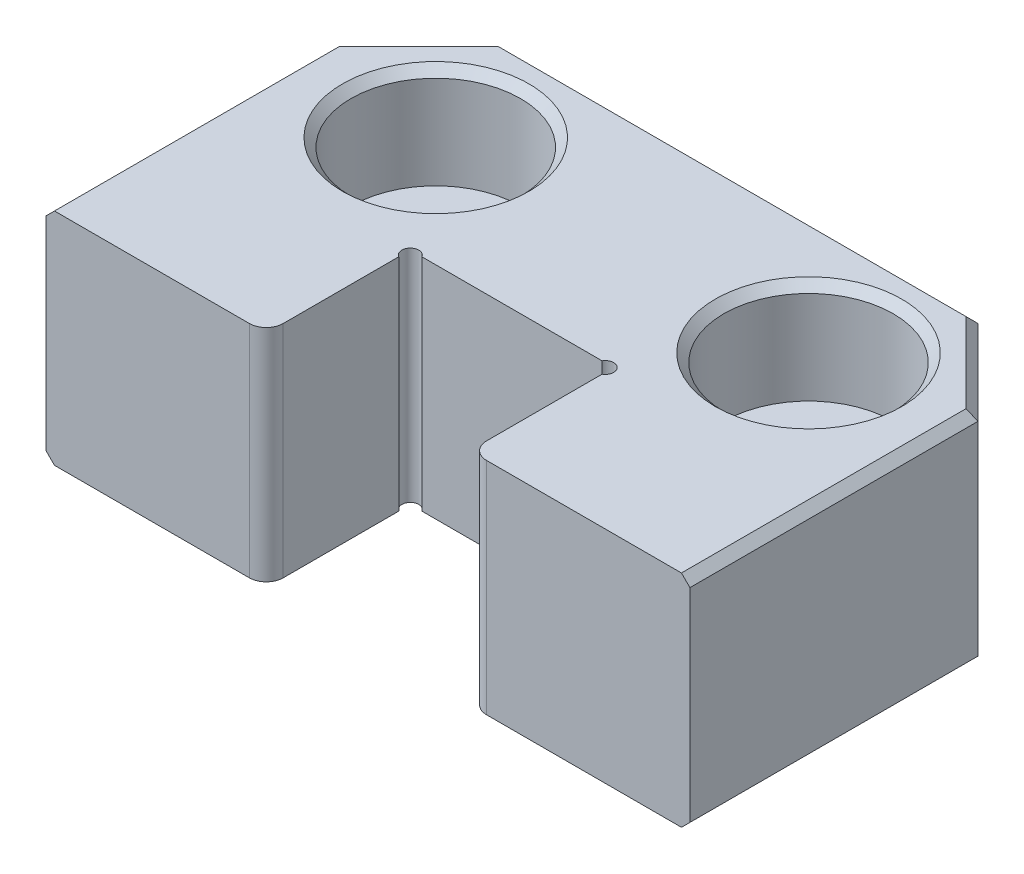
ISO-10303-21;
HEADER;
FILE_DESCRIPTION(('STEP AP214'),'2;1');
FILE_NAME('part.step','',(''),(''),'','','');
FILE_SCHEMA(('AUTOMOTIVE_DESIGN { 1 0 10303 214 1 1 1 1 }'));
ENDSEC;
DATA;
#1=APPLICATION_CONTEXT('core data for automotive mechanical design processes');
#2=APPLICATION_PROTOCOL_DEFINITION('international standard','automotive_design',2000,#1);
#3=PRODUCT_CONTEXT('',#1,'mechanical');
#4=PRODUCT('Part','Part','',(#3));
#5=PRODUCT_RELATED_PRODUCT_CATEGORY('part','',(#4));
#6=PRODUCT_DEFINITION_FORMATION('','',#4);
#7=PRODUCT_DEFINITION_CONTEXT('part definition',#1,'design');
#8=PRODUCT_DEFINITION('design','',#6,#7);
#9=PRODUCT_DEFINITION_SHAPE('','',#8);
#10=(LENGTH_UNIT() NAMED_UNIT(*) SI_UNIT(.MILLI.,.METRE.));
#11=(NAMED_UNIT(*) PLANE_ANGLE_UNIT() SI_UNIT($,.RADIAN.));
#12=(NAMED_UNIT(*) SI_UNIT($,.STERADIAN.) SOLID_ANGLE_UNIT());
#13=UNCERTAINTY_MEASURE_WITH_UNIT(LENGTH_MEASURE(1.E-05),#10,'distance_accuracy_value','');
#14=(GEOMETRIC_REPRESENTATION_CONTEXT(3) GLOBAL_UNCERTAINTY_ASSIGNED_CONTEXT((#13)) GLOBAL_UNIT_ASSIGNED_CONTEXT((#10,
#11,#12)) REPRESENTATION_CONTEXT('',''));
#15=CARTESIAN_POINT('',(0.,0.,0.));
#16=DIRECTION('',(0.,0.,1.));
#17=DIRECTION('',(1.,0.,0.));
#18=AXIS2_PLACEMENT_3D('',#15,#16,#17);
#19=CARTESIAN_POINT('',(-5.75,0.,-8.25));
#20=DIRECTION('',(0.,1.,0.));
#21=DIRECTION('',(0.,0.,1.));
#22=AXIS2_PLACEMENT_3D('',#19,#20,#21);
#23=PLANE('',#22);
#24=CARTESIAN_POINT('',(11.,0.,-15.));
#25=DIRECTION('',(0.,1.,0.));
#26=DIRECTION('',(0.,0.,1.));
#27=AXIS2_PLACEMENT_3D('',#24,#25,#26);
#28=CIRCLE('',#27,5.49999999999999);
#29=CARTESIAN_POINT('',(11.,0.,-9.50000000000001));
#30=VERTEX_POINT('',#29);
#31=EDGE_CURVE('E351',#30,#30,#28,.F.);
#32=ORIENTED_EDGE('',*,*,#31,.T.);
#33=EDGE_LOOP('',(#32));
#34=FACE_BOUND('',#33,.T.);
#35=CARTESIAN_POINT('',(-11.,0.,-15.));
#36=DIRECTION('',(0.,1.,0.));
#37=DIRECTION('',(0.,0.,1.));
#38=AXIS2_PLACEMENT_3D('',#35,#36,#37);
#39=CIRCLE('',#38,5.5);
#40=CARTESIAN_POINT('',(-11.,0.,-9.5));
#41=VERTEX_POINT('',#40);
#42=EDGE_CURVE('E324',#41,#41,#39,.F.);
#43=ORIENTED_EDGE('',*,*,#42,.T.);
#44=EDGE_LOOP('',(#43));
#45=FACE_BOUND('',#44,.T.);
#46=DIRECTION('',(-0.707106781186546,0.,0.707106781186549));
#47=VECTOR('',#46,1.);
#48=CARTESIAN_POINT('',(-16.3964466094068,0.,-18.8964466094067));
#49=LINE('',#48,#47);
#50=CARTESIAN_POINT('',(-13.7928932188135,0.,-21.5));
#51=VERTEX_POINT('',#50);
#52=CARTESIAN_POINT('',(-18.5,0.,-16.7928932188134));
#53=VERTEX_POINT('',#52);
#54=EDGE_CURVE('E47',#51,#53,#49,.T.);
#55=ORIENTED_EDGE('',*,*,#54,.T.);
#56=DIRECTION('',(0.,0.,1.));
#57=VECTOR('',#56,1.);
#58=CARTESIAN_POINT('',(-18.5,0.,-8.25));
#59=LINE('',#58,#57);
#60=CARTESIAN_POINT('',(-18.5,0.,0.));
#61=VERTEX_POINT('',#60);
#62=EDGE_CURVE('E322',#53,#61,#59,.T.);
#63=ORIENTED_EDGE('',*,*,#62,.T.);
#64=DIRECTION('',(1.,0.,0.));
#65=VECTOR('',#64,1.);
#66=CARTESIAN_POINT('',(-19.,0.,0.));
#67=LINE('',#66,#65);
#68=CARTESIAN_POINT('',(-7.,0.,0.));
#69=VERTEX_POINT('',#68);
#70=EDGE_CURVE('E211',#61,#69,#67,.T.);
#71=ORIENTED_EDGE('',*,*,#70,.T.);
#72=CARTESIAN_POINT('',(-7.,0.,-1.));
#73=DIRECTION('',(0.,1.,0.));
#74=DIRECTION('',(0.,0.,1.));
#75=AXIS2_PLACEMENT_3D('',#72,#73,#74);
#76=CIRCLE('',#75,1.);
#77=CARTESIAN_POINT('',(-6.,0.,-1.));
#78=VERTEX_POINT('',#77);
#79=EDGE_CURVE('E254',#69,#78,#76,.T.);
#80=ORIENTED_EDGE('',*,*,#79,.T.);
#81=DIRECTION('',(0.,0.,-1.));
#82=VECTOR('',#81,1.);
#83=CARTESIAN_POINT('',(-6.,0.,0.));
#84=LINE('',#83,#82);
#85=CARTESIAN_POINT('',(-6.,0.,-7.81698729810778));
#86=VERTEX_POINT('',#85);
#87=EDGE_CURVE('E213',#78,#86,#84,.T.);
#88=ORIENTED_EDGE('',*,*,#87,.T.);
#89=CARTESIAN_POINT('',(-5.75,0.,-8.25));
#90=DIRECTION('',(0.,-1.,0.));
#91=DIRECTION('',(0.,0.,1.));
#92=AXIS2_PLACEMENT_3D('',#89,#90,#91);
#93=CIRCLE('',#92,0.500000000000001);
#94=CARTESIAN_POINT('',(-5.31698729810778,0.,-8.5));
#95=VERTEX_POINT('',#94);
#96=EDGE_CURVE('E188',#86,#95,#93,.T.);
#97=ORIENTED_EDGE('',*,*,#96,.T.);
#98=DIRECTION('',(1.,0.,0.));
#99=VECTOR('',#98,1.);
#100=CARTESIAN_POINT('',(-5.31698729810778,0.,-8.5));
#101=LINE('',#100,#99);
#102=CARTESIAN_POINT('',(5.31698729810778,0.,-8.5));
#103=VERTEX_POINT('',#102);
#104=EDGE_CURVE('E217',#95,#103,#101,.T.);
#105=ORIENTED_EDGE('',*,*,#104,.T.);
#106=CARTESIAN_POINT('',(5.75,0.,-8.25));
#107=DIRECTION('',(0.,-1.,0.));
#108=DIRECTION('',(0.,0.,1.));
#109=AXIS2_PLACEMENT_3D('',#106,#107,#108);
#110=CIRCLE('',#109,0.500000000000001);
#111=CARTESIAN_POINT('',(6.,0.,-7.81698729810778));
#112=VERTEX_POINT('',#111);
#113=EDGE_CURVE('E220',#103,#112,#110,.T.);
#114=ORIENTED_EDGE('',*,*,#113,.T.);
#115=DIRECTION('',(0.,0.,1.));
#116=VECTOR('',#115,1.);
#117=CARTESIAN_POINT('',(6.,0.,-7.81698729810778));
#118=LINE('',#117,#116);
#119=CARTESIAN_POINT('',(6.,0.,-1.));
#120=VERTEX_POINT('',#119);
#121=EDGE_CURVE('E223',#112,#120,#118,.T.);
#122=ORIENTED_EDGE('',*,*,#121,.T.);
#123=CARTESIAN_POINT('',(7.,0.,-1.));
#124=DIRECTION('',(0.,1.,0.));
#125=DIRECTION('',(0.,0.,1.));
#126=AXIS2_PLACEMENT_3D('',#123,#124,#125);
#127=CIRCLE('',#126,1.);
#128=CARTESIAN_POINT('',(7.,0.,0.));
#129=VERTEX_POINT('',#128);
#130=EDGE_CURVE('E256',#120,#129,#127,.T.);
#131=ORIENTED_EDGE('',*,*,#130,.T.);
#132=DIRECTION('',(1.,0.,0.));
#133=VECTOR('',#132,1.);
#134=CARTESIAN_POINT('',(19.,0.,0.));
#135=LINE('',#134,#133);
#136=CARTESIAN_POINT('',(18.5,0.,0.));
#137=VERTEX_POINT('',#136);
#138=EDGE_CURVE('E226',#129,#137,#135,.T.);
#139=ORIENTED_EDGE('',*,*,#138,.T.);
#140=DIRECTION('',(0.,0.,-1.));
#141=VECTOR('',#140,1.);
#142=CARTESIAN_POINT('',(18.5,0.,-8.25));
#143=LINE('',#142,#141);
#144=CARTESIAN_POINT('',(18.5,0.,-16.7928932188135));
#145=VERTEX_POINT('',#144);
#146=EDGE_CURVE('E316',#137,#145,#143,.T.);
#147=ORIENTED_EDGE('',*,*,#146,.T.);
#148=DIRECTION('',(-0.707106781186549,0.,-0.707106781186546));
#149=VECTOR('',#148,1.);
#150=CARTESIAN_POINT('',(10.6464466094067,0.,-24.6464466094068));
#151=LINE('',#150,#149);
#152=CARTESIAN_POINT('',(13.7928932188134,0.,-21.5));
#153=VERTEX_POINT('',#152);
#154=EDGE_CURVE('E318',#145,#153,#151,.T.);
#155=ORIENTED_EDGE('',*,*,#154,.T.);
#156=DIRECTION('',(-1.,0.,0.));
#157=VECTOR('',#156,1.);
#158=CARTESIAN_POINT('',(-5.75,0.,-21.5));
#159=LINE('',#158,#157);
#160=EDGE_CURVE('E52',#153,#51,#159,.T.);
#161=ORIENTED_EDGE('',*,*,#160,.T.);
#162=EDGE_LOOP('',(#55,#63,#71,#80,#88,#97,#105,#114,#122,#131,#139,#147,#155,#161));
#163=FACE_BOUND('',#162,.T.);
#164=ADVANCED_FACE('F32',(#34,#45,#163),#23,.T.);
#165=CARTESIAN_POINT('',(11.,-13.,-15.));
#166=DIRECTION('',(0.,1.,0.));
#167=DIRECTION('',(0.,0.,1.));
#168=AXIS2_PLACEMENT_3D('',#165,#166,#167);
#169=CYLINDRICAL_SURFACE('',#168,2.9);
#170=CARTESIAN_POINT('',(11.,-13.,-15.));
#171=DIRECTION('',(0.,1.,0.));
#172=DIRECTION('',(0.,0.,1.));
#173=AXIS2_PLACEMENT_3D('',#170,#171,#172);
#174=CIRCLE('',#173,2.9);
#175=CARTESIAN_POINT('',(11.,-13.,-12.1));
#176=VERTEX_POINT('',#175);
#177=EDGE_CURVE('E214',#176,#176,#174,.T.);
#178=CARTESIAN_POINT('',(11.,-6.,-15.));
#179=DIRECTION('',(0.,1.,0.));
#180=DIRECTION('',(0.,0.,1.));
#181=AXIS2_PLACEMENT_3D('',#178,#179,#180);
#182=CIRCLE('',#181,2.9);
#183=CARTESIAN_POINT('',(11.,-6.,-12.1));
#184=VERTEX_POINT('',#183);
#185=EDGE_CURVE('E274',#184,#184,#182,.F.);
#186=CARTESIAN_POINT('',(11.,-13.,-12.1));
#187=CARTESIAN_POINT('',(11.,-12.9270833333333,-12.1));
#188=CARTESIAN_POINT('',(11.,-12.8541666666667,-12.1));
#189=CARTESIAN_POINT('',(11.,-12.7083333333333,-12.1));
#190=CARTESIAN_POINT('',(11.,-12.6354166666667,-12.1));
#191=CARTESIAN_POINT('',(11.,-12.4895833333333,-12.1));
#192=CARTESIAN_POINT('',(11.,-12.4166666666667,-12.1));
#193=CARTESIAN_POINT('',(11.,-12.2708333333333,-12.1));
#194=CARTESIAN_POINT('',(11.,-12.1979166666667,-12.1));
#195=CARTESIAN_POINT('',(11.,-12.0520833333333,-12.1));
#196=CARTESIAN_POINT('',(11.,-11.9791666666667,-12.1));
#197=CARTESIAN_POINT('',(11.,-11.8333333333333,-12.1));
#198=CARTESIAN_POINT('',(11.,-11.7604166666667,-12.1));
#199=CARTESIAN_POINT('',(11.,-11.6145833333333,-12.1));
#200=CARTESIAN_POINT('',(11.,-11.5416666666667,-12.1));
#201=CARTESIAN_POINT('',(11.,-11.3958333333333,-12.1));
#202=CARTESIAN_POINT('',(11.,-11.3229166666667,-12.1));
#203=CARTESIAN_POINT('',(11.,-11.1770833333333,-12.1));
#204=CARTESIAN_POINT('',(11.,-11.1041666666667,-12.1));
#205=CARTESIAN_POINT('',(11.,-10.9583333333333,-12.1));
#206=CARTESIAN_POINT('',(11.,-10.8854166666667,-12.1));
#207=CARTESIAN_POINT('',(11.,-10.7395833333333,-12.1));
#208=CARTESIAN_POINT('',(11.,-10.6666666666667,-12.1));
#209=CARTESIAN_POINT('',(11.,-10.5208333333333,-12.1));
#210=CARTESIAN_POINT('',(11.,-10.4479166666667,-12.1));
#211=CARTESIAN_POINT('',(11.,-10.3020833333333,-12.1));
#212=CARTESIAN_POINT('',(11.,-10.2291666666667,-12.1));
#213=CARTESIAN_POINT('',(11.,-10.0833333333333,-12.1));
#214=CARTESIAN_POINT('',(11.,-10.0104166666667,-12.1));
#215=CARTESIAN_POINT('',(11.,-9.86458333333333,-12.1));
#216=CARTESIAN_POINT('',(11.,-9.79166666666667,-12.1));
#217=CARTESIAN_POINT('',(11.,-9.64583333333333,-12.1));
#218=CARTESIAN_POINT('',(11.,-9.57291666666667,-12.1));
#219=CARTESIAN_POINT('',(11.,-9.42708333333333,-12.1));
#220=CARTESIAN_POINT('',(11.,-9.35416666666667,-12.1));
#221=CARTESIAN_POINT('',(11.,-9.20833333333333,-12.1));
#222=CARTESIAN_POINT('',(11.,-9.13541666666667,-12.1));
#223=CARTESIAN_POINT('',(11.,-8.98958333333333,-12.1));
#224=CARTESIAN_POINT('',(11.,-8.91666666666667,-12.1));
#225=CARTESIAN_POINT('',(11.,-8.77083333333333,-12.1));
#226=CARTESIAN_POINT('',(11.,-8.69791666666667,-12.1));
#227=CARTESIAN_POINT('',(11.,-8.55208333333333,-12.1));
#228=CARTESIAN_POINT('',(11.,-8.47916666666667,-12.1));
#229=CARTESIAN_POINT('',(11.,-8.33333333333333,-12.1));
#230=CARTESIAN_POINT('',(11.,-8.26041666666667,-12.1));
#231=CARTESIAN_POINT('',(11.,-8.11458333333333,-12.1));
#232=CARTESIAN_POINT('',(11.,-8.04166666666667,-12.1));
#233=CARTESIAN_POINT('',(11.,-7.89583333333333,-12.1));
#234=CARTESIAN_POINT('',(11.,-7.82291666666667,-12.1));
#235=CARTESIAN_POINT('',(11.,-7.67708333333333,-12.1));
#236=CARTESIAN_POINT('',(11.,-7.60416666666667,-12.1));
#237=CARTESIAN_POINT('',(11.,-7.45833333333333,-12.1));
#238=CARTESIAN_POINT('',(11.,-7.38541666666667,-12.1));
#239=CARTESIAN_POINT('',(11.,-7.23958333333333,-12.1));
#240=CARTESIAN_POINT('',(11.,-7.16666666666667,-12.1));
#241=CARTESIAN_POINT('',(11.,-7.02083333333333,-12.1));
#242=CARTESIAN_POINT('',(11.,-6.94791666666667,-12.1));
#243=CARTESIAN_POINT('',(11.,-6.80208333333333,-12.1));
#244=CARTESIAN_POINT('',(11.,-6.72916666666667,-12.1));
#245=CARTESIAN_POINT('',(11.,-6.58333333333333,-12.1));
#246=CARTESIAN_POINT('',(11.,-6.51041666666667,-12.1));
#247=CARTESIAN_POINT('',(11.,-6.36458333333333,-12.1));
#248=CARTESIAN_POINT('',(11.,-6.29166666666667,-12.1));
#249=CARTESIAN_POINT('',(11.,-6.14583333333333,-12.1));
#250=CARTESIAN_POINT('',(11.,-6.07291666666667,-12.1));
#251=CARTESIAN_POINT('',(11.,-6.,-12.1));
#252=B_SPLINE_CURVE_WITH_KNOTS('',3,(#186,#187,#188,#189,#190,#191,#192,#193,#194,#195,#196,
#197,#198,#199,#200,#201,#202,#203,#204,#205,#206,#207,#208,#209,#210,#211,#212,#213,#214,#215,
#216,#217,#218,#219,#220,#221,#222,#223,#224,#225,#226,#227,#228,#229,#230,#231,#232,#233,#234,
#235,#236,#237,#238,#239,#240,#241,#242,#243,#244,#245,#246,#247,#248,#249,#250,#251),
.UNSPECIFIED.,.F.,.F.,(4,2,2,2,2,2,2,2,2,2,2,2,2,2,2,2,2,2,2,2,2,2,2,2,2,2,2,2,2,2,2,2,4),(0.,
0.218749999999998,0.437499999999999,0.656249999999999,0.874999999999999,1.09375,1.3125,1.53125,
1.75,1.96875,2.1875,2.40625,2.625,2.84375,3.0625,3.28125,3.5,3.71875,3.9375,4.15625,4.375,
4.59375,4.8125,5.03125,5.25,5.46875,5.6875,5.90625,6.125,6.34375,6.5625,6.78125,7.),.UNSPECIFIED.);
#253=EDGE_CURVE('BSEAM367',#176,#184,#252,.T.);
#254=ORIENTED_EDGE('',*,*,#177,.F.);
#255=ORIENTED_EDGE('',*,*,#185,.F.);
#256=ORIENTED_EDGE('',*,*,#253,.T.);
#257=ORIENTED_EDGE('',*,*,#253,.F.);
#258=EDGE_LOOP('',(#254,#256,#255,#257));
#259=FACE_BOUND('',#258,.T.);
#260=ADVANCED_FACE('F367',(#259),#169,.F.);
#261=CARTESIAN_POINT('',(-11.,-13.,-15.));
#262=DIRECTION('',(0.,1.,0.));
#263=DIRECTION('',(0.,0.,1.));
#264=AXIS2_PLACEMENT_3D('',#261,#262,#263);
#265=CYLINDRICAL_SURFACE('',#264,2.9);
#266=CARTESIAN_POINT('',(-11.,-13.,-15.));
#267=DIRECTION('',(0.,1.,0.));
#268=DIRECTION('',(0.,0.,1.));
#269=AXIS2_PLACEMENT_3D('',#266,#267,#268);
#270=CIRCLE('',#269,2.9);
#271=CARTESIAN_POINT('',(-11.,-13.,-12.1));
#272=VERTEX_POINT('',#271);
#273=EDGE_CURVE('E272',#272,#272,#270,.T.);
#274=CARTESIAN_POINT('',(-11.,-6.,-15.));
#275=DIRECTION('',(0.,1.,0.));
#276=DIRECTION('',(0.,0.,1.));
#277=AXIS2_PLACEMENT_3D('',#274,#275,#276);
#278=CIRCLE('',#277,2.9);
#279=CARTESIAN_POINT('',(-11.,-6.,-12.1));
#280=VERTEX_POINT('',#279);
#281=EDGE_CURVE('E269',#280,#280,#278,.F.);
#282=CARTESIAN_POINT('',(-11.,-13.,-12.1));
#283=CARTESIAN_POINT('',(-11.,-12.9270833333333,-12.1));
#284=CARTESIAN_POINT('',(-11.,-12.8541666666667,-12.1));
#285=CARTESIAN_POINT('',(-11.,-12.7083333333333,-12.1));
#286=CARTESIAN_POINT('',(-11.,-12.6354166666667,-12.1));
#287=CARTESIAN_POINT('',(-11.,-12.4895833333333,-12.1));
#288=CARTESIAN_POINT('',(-11.,-12.4166666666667,-12.1));
#289=CARTESIAN_POINT('',(-11.,-12.2708333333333,-12.1));
#290=CARTESIAN_POINT('',(-11.,-12.1979166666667,-12.1));
#291=CARTESIAN_POINT('',(-11.,-12.0520833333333,-12.1));
#292=CARTESIAN_POINT('',(-11.,-11.9791666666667,-12.1));
#293=CARTESIAN_POINT('',(-11.,-11.8333333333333,-12.1));
#294=CARTESIAN_POINT('',(-11.,-11.7604166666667,-12.1));
#295=CARTESIAN_POINT('',(-11.,-11.6145833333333,-12.1));
#296=CARTESIAN_POINT('',(-11.,-11.5416666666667,-12.1));
#297=CARTESIAN_POINT('',(-11.,-11.3958333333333,-12.1));
#298=CARTESIAN_POINT('',(-11.,-11.3229166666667,-12.1));
#299=CARTESIAN_POINT('',(-11.,-11.1770833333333,-12.1));
#300=CARTESIAN_POINT('',(-11.,-11.1041666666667,-12.1));
#301=CARTESIAN_POINT('',(-11.,-10.9583333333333,-12.1));
#302=CARTESIAN_POINT('',(-11.,-10.8854166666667,-12.1));
#303=CARTESIAN_POINT('',(-11.,-10.7395833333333,-12.1));
#304=CARTESIAN_POINT('',(-11.,-10.6666666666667,-12.1));
#305=CARTESIAN_POINT('',(-11.,-10.5208333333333,-12.1));
#306=CARTESIAN_POINT('',(-11.,-10.4479166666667,-12.1));
#307=CARTESIAN_POINT('',(-11.,-10.3020833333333,-12.1));
#308=CARTESIAN_POINT('',(-11.,-10.2291666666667,-12.1));
#309=CARTESIAN_POINT('',(-11.,-10.0833333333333,-12.1));
#310=CARTESIAN_POINT('',(-11.,-10.0104166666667,-12.1));
#311=CARTESIAN_POINT('',(-11.,-9.86458333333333,-12.1));
#312=CARTESIAN_POINT('',(-11.,-9.79166666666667,-12.1));
#313=CARTESIAN_POINT('',(-11.,-9.64583333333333,-12.1));
#314=CARTESIAN_POINT('',(-11.,-9.57291666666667,-12.1));
#315=CARTESIAN_POINT('',(-11.,-9.42708333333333,-12.1));
#316=CARTESIAN_POINT('',(-11.,-9.35416666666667,-12.1));
#317=CARTESIAN_POINT('',(-11.,-9.20833333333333,-12.1));
#318=CARTESIAN_POINT('',(-11.,-9.13541666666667,-12.1));
#319=CARTESIAN_POINT('',(-11.,-8.98958333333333,-12.1));
#320=CARTESIAN_POINT('',(-11.,-8.91666666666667,-12.1));
#321=CARTESIAN_POINT('',(-11.,-8.77083333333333,-12.1));
#322=CARTESIAN_POINT('',(-11.,-8.69791666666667,-12.1));
#323=CARTESIAN_POINT('',(-11.,-8.55208333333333,-12.1));
#324=CARTESIAN_POINT('',(-11.,-8.47916666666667,-12.1));
#325=CARTESIAN_POINT('',(-11.,-8.33333333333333,-12.1));
#326=CARTESIAN_POINT('',(-11.,-8.26041666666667,-12.1));
#327=CARTESIAN_POINT('',(-11.,-8.11458333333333,-12.1));
#328=CARTESIAN_POINT('',(-11.,-8.04166666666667,-12.1));
#329=CARTESIAN_POINT('',(-11.,-7.89583333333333,-12.1));
#330=CARTESIAN_POINT('',(-11.,-7.82291666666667,-12.1));
#331=CARTESIAN_POINT('',(-11.,-7.67708333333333,-12.1));
#332=CARTESIAN_POINT('',(-11.,-7.60416666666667,-12.1));
#333=CARTESIAN_POINT('',(-11.,-7.45833333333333,-12.1));
#334=CARTESIAN_POINT('',(-11.,-7.38541666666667,-12.1));
#335=CARTESIAN_POINT('',(-11.,-7.23958333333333,-12.1));
#336=CARTESIAN_POINT('',(-11.,-7.16666666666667,-12.1));
#337=CARTESIAN_POINT('',(-11.,-7.02083333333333,-12.1));
#338=CARTESIAN_POINT('',(-11.,-6.94791666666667,-12.1));
#339=CARTESIAN_POINT('',(-11.,-6.80208333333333,-12.1));
#340=CARTESIAN_POINT('',(-11.,-6.72916666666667,-12.1));
#341=CARTESIAN_POINT('',(-11.,-6.58333333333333,-12.1));
#342=CARTESIAN_POINT('',(-11.,-6.51041666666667,-12.1));
#343=CARTESIAN_POINT('',(-11.,-6.36458333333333,-12.1));
#344=CARTESIAN_POINT('',(-11.,-6.29166666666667,-12.1));
#345=CARTESIAN_POINT('',(-11.,-6.14583333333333,-12.1));
#346=CARTESIAN_POINT('',(-11.,-6.07291666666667,-12.1));
#347=CARTESIAN_POINT('',(-11.,-6.,-12.1));
#348=B_SPLINE_CURVE_WITH_KNOTS('',3,(#282,#283,#284,#285,#286,#287,#288,#289,#290,#291,#292,
#293,#294,#295,#296,#297,#298,#299,#300,#301,#302,#303,#304,#305,#306,#307,#308,#309,#310,#311,
#312,#313,#314,#315,#316,#317,#318,#319,#320,#321,#322,#323,#324,#325,#326,#327,#328,#329,#330,
#331,#332,#333,#334,#335,#336,#337,#338,#339,#340,#341,#342,#343,#344,#345,#346,#347),
.UNSPECIFIED.,.F.,.F.,(4,2,2,2,2,2,2,2,2,2,2,2,2,2,2,2,2,2,2,2,2,2,2,2,2,2,2,2,2,2,2,2,4),(0.,
0.218749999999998,0.437499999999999,0.656249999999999,0.874999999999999,1.09375,1.3125,1.53125,
1.75,1.96875,2.1875,2.40625,2.625,2.84375,3.0625,3.28125,3.5,3.71875,3.9375,4.15625,4.375,
4.59375,4.8125,5.03125,5.25,5.46875,5.6875,5.90625,6.125,6.34375,6.5625,6.78125,7.),.UNSPECIFIED.);
#349=EDGE_CURVE('BSEAM474',#272,#280,#348,.T.);
#350=ORIENTED_EDGE('',*,*,#273,.F.);
#351=ORIENTED_EDGE('',*,*,#281,.F.);
#352=ORIENTED_EDGE('',*,*,#349,.T.);
#353=ORIENTED_EDGE('',*,*,#349,.F.);
#354=EDGE_LOOP('',(#350,#352,#351,#353));
#355=FACE_BOUND('',#354,.T.);
#356=ADVANCED_FACE('F474',(#355),#265,.F.);
#357=CARTESIAN_POINT('',(-19.,-13.,-22.));
#358=DIRECTION('',(-1.,0.,0.));
#359=DIRECTION('',(0.,0.,1.));
#360=AXIS2_PLACEMENT_3D('',#357,#358,#359);
#361=PLANE('',#360);
#362=DIRECTION('',(0.,-1.,0.));
#363=VECTOR('',#362,1.);
#364=CARTESIAN_POINT('',(-19.,-13.,-17.));
#365=LINE('',#364,#363);
#366=CARTESIAN_POINT('',(-19.,-0.5,-17.));
#367=VERTEX_POINT('',#366);
#368=CARTESIAN_POINT('',(-19.,-12.5,-17.));
#369=VERTEX_POINT('',#368);
#370=EDGE_CURVE('E245',#367,#369,#365,.T.);
#371=ORIENTED_EDGE('',*,*,#370,.T.);
#372=DIRECTION('',(0.,0.,1.));
#373=VECTOR('',#372,1.);
#374=CARTESIAN_POINT('',(-19.,-12.5,0.));
#375=LINE('',#374,#373);
#376=CARTESIAN_POINT('',(-19.,-12.5,0.));
#377=VERTEX_POINT('',#376);
#378=EDGE_CURVE('E279',#369,#377,#375,.T.);
#379=ORIENTED_EDGE('',*,*,#378,.T.);
#380=DIRECTION('',(0.,1.,0.));
#381=VECTOR('',#380,1.);
#382=CARTESIAN_POINT('',(-19.,-13.,0.));
#383=LINE('',#382,#381);
#384=CARTESIAN_POINT('',(-19.,-0.500000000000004,0.));
#385=VERTEX_POINT('',#384);
#386=EDGE_CURVE('E190',#377,#385,#383,.T.);
#387=ORIENTED_EDGE('',*,*,#386,.T.);
#388=DIRECTION('',(0.,0.,-1.));
#389=VECTOR('',#388,1.);
#390=CARTESIAN_POINT('',(-19.,-0.5,-22.));
#391=LINE('',#390,#389);
#392=EDGE_CURVE('E268',#385,#367,#391,.T.);
#393=ORIENTED_EDGE('',*,*,#392,.T.);
#394=EDGE_LOOP('',(#371,#379,#387,#393));
#395=FACE_BOUND('',#394,.T.);
#396=ADVANCED_FACE('F403',(#395),#361,.T.);
#397=CARTESIAN_POINT('',(-19.,-13.,-22.));
#398=DIRECTION('',(0.,0.,-1.));
#399=DIRECTION('',(-1.,0.,0.));
#400=AXIS2_PLACEMENT_3D('',#397,#398,#399);
#401=PLANE('',#400);
#402=DIRECTION('',(0.,-1.,0.));
#403=VECTOR('',#402,1.);
#404=CARTESIAN_POINT('',(14.,-13.,-22.));
#405=LINE('',#404,#403);
#406=CARTESIAN_POINT('',(14.,-0.5,-22.));
#407=VERTEX_POINT('',#406);
#408=CARTESIAN_POINT('',(14.,-12.5,-22.));
#409=VERTEX_POINT('',#408);
#410=EDGE_CURVE('E232',#407,#409,#405,.T.);
#411=ORIENTED_EDGE('',*,*,#410,.T.);
#412=DIRECTION('',(-1.,0.,0.));
#413=VECTOR('',#412,1.);
#414=CARTESIAN_POINT('',(-14.,-12.5,-22.));
#415=LINE('',#414,#413);
#416=CARTESIAN_POINT('',(-14.,-12.5,-22.));
#417=VERTEX_POINT('',#416);
#418=EDGE_CURVE('E302',#409,#417,#415,.T.);
#419=ORIENTED_EDGE('',*,*,#418,.T.);
#420=DIRECTION('',(0.,1.,0.));
#421=VECTOR('',#420,1.);
#422=CARTESIAN_POINT('',(-14.,-13.,-22.));
#423=LINE('',#422,#421);
#424=CARTESIAN_POINT('',(-14.,-0.5,-22.));
#425=VERTEX_POINT('',#424);
#426=EDGE_CURVE('E242',#417,#425,#423,.T.);
#427=ORIENTED_EDGE('',*,*,#426,.T.);
#428=DIRECTION('',(1.,0.,0.));
#429=VECTOR('',#428,1.);
#430=CARTESIAN_POINT('',(-19.,-0.5,-22.));
#431=LINE('',#430,#429);
#432=EDGE_CURVE('E300',#425,#407,#431,.T.);
#433=ORIENTED_EDGE('',*,*,#432,.T.);
#434=EDGE_LOOP('',(#411,#419,#427,#433));
#435=FACE_BOUND('',#434,.T.);
#436=ADVANCED_FACE('F415',(#435),#401,.T.);
#437=CARTESIAN_POINT('',(19.,-13.,-22.));
#438=DIRECTION('',(1.,0.,0.));
#439=DIRECTION('',(0.,0.,-1.));
#440=AXIS2_PLACEMENT_3D('',#437,#438,#439);
#441=PLANE('',#440);
#442=DIRECTION('',(0.,1.,0.));
#443=VECTOR('',#442,1.);
#444=CARTESIAN_POINT('',(19.,-13.,0.));
#445=LINE('',#444,#443);
#446=CARTESIAN_POINT('',(19.,-12.5,0.));
#447=VERTEX_POINT('',#446);
#448=CARTESIAN_POINT('',(19.,-0.500000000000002,0.));
#449=VERTEX_POINT('',#448);
#450=EDGE_CURVE('E229',#447,#449,#445,.T.);
#451=ORIENTED_EDGE('',*,*,#450,.F.);
#452=DIRECTION('',(0.,0.,-1.));
#453=VECTOR('',#452,1.);
#454=CARTESIAN_POINT('',(19.,-12.5,-17.));
#455=LINE('',#454,#453);
#456=CARTESIAN_POINT('',(19.,-12.5,-17.));
#457=VERTEX_POINT('',#456);
#458=EDGE_CURVE('E310',#447,#457,#455,.T.);
#459=ORIENTED_EDGE('',*,*,#458,.T.);
#460=DIRECTION('',(0.,1.,0.));
#461=VECTOR('',#460,1.);
#462=CARTESIAN_POINT('',(19.,-13.,-17.));
#463=LINE('',#462,#461);
#464=CARTESIAN_POINT('',(19.,-0.5,-17.));
#465=VERTEX_POINT('',#464);
#466=EDGE_CURVE('E248',#457,#465,#463,.T.);
#467=ORIENTED_EDGE('',*,*,#466,.T.);
#468=DIRECTION('',(0.,0.,1.));
#469=VECTOR('',#468,1.);
#470=CARTESIAN_POINT('',(19.,-0.5,-22.));
#471=LINE('',#470,#469);
#472=EDGE_CURVE('E308',#465,#449,#471,.T.);
#473=ORIENTED_EDGE('',*,*,#472,.T.);
#474=EDGE_LOOP('',(#451,#459,#467,#473));
#475=FACE_BOUND('',#474,.T.);
#476=ADVANCED_FACE('F433',(#475),#441,.T.);
#477=CARTESIAN_POINT('',(19.,-13.,0.));
#478=DIRECTION('',(0.,0.,1.));
#479=DIRECTION('',(1.,0.,0.));
#480=AXIS2_PLACEMENT_3D('',#477,#478,#479);
#481=PLANE('',#480);
#482=DIRECTION('',(1.,0.,0.));
#483=VECTOR('',#482,1.);
#484=CARTESIAN_POINT('',(19.,-13.,0.));
#485=LINE('',#484,#483);
#486=CARTESIAN_POINT('',(7.,-13.,0.));
#487=VERTEX_POINT('',#486);
#488=CARTESIAN_POINT('',(18.5,-13.,0.));
#489=VERTEX_POINT('',#488);
#490=EDGE_CURVE('E208',#487,#489,#485,.T.);
#491=ORIENTED_EDGE('',*,*,#490,.T.);
#492=DIRECTION('',(0.707106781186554,0.707106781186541,0.));
#493=VECTOR('',#492,1.);
#494=CARTESIAN_POINT('',(18.75,-12.75,0.));
#495=LINE('',#494,#493);
#496=EDGE_CURVE('E314',#489,#447,#495,.T.);
#497=ORIENTED_EDGE('',*,*,#496,.T.);
#498=ORIENTED_EDGE('',*,*,#450,.T.);
#499=DIRECTION('',(0.707106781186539,-0.707106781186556,0.));
#500=VECTOR('',#499,1.);
#501=CARTESIAN_POINT('',(25.25,-6.75000000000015,0.));
#502=LINE('',#501,#500);
#503=EDGE_CURVE('E312',#449,#137,#502,.F.);
#504=ORIENTED_EDGE('',*,*,#503,.T.);
#505=ORIENTED_EDGE('',*,*,#138,.F.);
#506=DIRECTION('',(0.,1.,0.));
#507=VECTOR('',#506,1.);
#508=CARTESIAN_POINT('',(7.,-13.,0.));
#509=LINE('',#508,#507);
#510=EDGE_CURVE('E258',#129,#487,#509,.F.);
#511=ORIENTED_EDGE('',*,*,#510,.T.);
#512=EDGE_LOOP('',(#491,#497,#498,#504,#505,#511));
#513=FACE_BOUND('',#512,.T.);
#514=ADVANCED_FACE('F441',(#513),#481,.T.);
#515=CARTESIAN_POINT('',(6.,-13.,-7.81698729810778));
#516=DIRECTION('',(-1.,0.,0.));
#517=DIRECTION('',(0.,0.,1.));
#518=AXIS2_PLACEMENT_3D('',#515,#516,#517);
#519=PLANE('',#518);
#520=DIRECTION('',(0.,0.,1.));
#521=VECTOR('',#520,1.);
#522=CARTESIAN_POINT('',(6.,-13.,-7.81698729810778));
#523=LINE('',#522,#521);
#524=CARTESIAN_POINT('',(6.,-13.,-7.81698729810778));
#525=VERTEX_POINT('',#524);
#526=CARTESIAN_POINT('',(6.,-13.,-1.));
#527=VERTEX_POINT('',#526);
#528=EDGE_CURVE('E205',#525,#527,#523,.T.);
#529=ORIENTED_EDGE('',*,*,#528,.T.);
#530=DIRECTION('',(0.,1.,0.));
#531=VECTOR('',#530,1.);
#532=CARTESIAN_POINT('',(6.,-13.,-1.));
#533=LINE('',#532,#531);
#534=EDGE_CURVE('E251',#527,#120,#533,.T.);
#535=ORIENTED_EDGE('',*,*,#534,.T.);
#536=ORIENTED_EDGE('',*,*,#121,.F.);
#537=DIRECTION('',(0.,1.,0.));
#538=VECTOR('',#537,1.);
#539=CARTESIAN_POINT('',(6.,-13.,-7.81698729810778));
#540=LINE('',#539,#538);
#541=EDGE_CURVE('E233',#525,#112,#540,.T.);
#542=ORIENTED_EDGE('',*,*,#541,.F.);
#543=EDGE_LOOP('',(#529,#535,#536,#542));
#544=FACE_BOUND('',#543,.T.);
#545=ADVANCED_FACE('F449',(#544),#519,.T.);
#546=CARTESIAN_POINT('',(5.75,-13.,-8.25));
#547=DIRECTION('',(0.,1.,0.));
#548=DIRECTION('',(0.,0.,1.));
#549=AXIS2_PLACEMENT_3D('',#546,#547,#548);
#550=CYLINDRICAL_SURFACE('',#549,0.500000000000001);
#551=ORIENTED_EDGE('',*,*,#113,.F.);
#552=DIRECTION('',(0.,1.,0.));
#553=VECTOR('',#552,1.);
#554=CARTESIAN_POINT('',(5.31698729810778,-13.,-8.5));
#555=LINE('',#554,#553);
#556=CARTESIAN_POINT('',(5.31698729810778,-13.,-8.5));
#557=VERTEX_POINT('',#556);
#558=EDGE_CURVE('E235',#557,#103,#555,.T.);
#559=ORIENTED_EDGE('',*,*,#558,.F.);
#560=CARTESIAN_POINT('',(5.75,-13.,-8.25));
#561=DIRECTION('',(0.,-1.,0.));
#562=DIRECTION('',(0.,0.,1.));
#563=AXIS2_PLACEMENT_3D('',#560,#561,#562);
#564=CIRCLE('',#563,0.500000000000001);
#565=EDGE_CURVE('E199',#557,#525,#564,.T.);
#566=ORIENTED_EDGE('',*,*,#565,.T.);
#567=ORIENTED_EDGE('',*,*,#541,.T.);
#568=EDGE_LOOP('',(#551,#559,#566,#567));
#569=FACE_BOUND('',#568,.T.);
#570=ADVANCED_FACE('F454',(#569),#550,.F.);
#571=CARTESIAN_POINT('',(-5.31698729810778,-13.,-8.5));
#572=DIRECTION('',(0.,0.,1.));
#573=DIRECTION('',(1.,0.,0.));
#574=AXIS2_PLACEMENT_3D('',#571,#572,#573);
#575=PLANE('',#574);
#576=ORIENTED_EDGE('',*,*,#104,.F.);
#577=DIRECTION('',(0.,1.,0.));
#578=VECTOR('',#577,1.);
#579=CARTESIAN_POINT('',(-5.31698729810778,-13.,-8.5));
#580=LINE('',#579,#578);
#581=CARTESIAN_POINT('',(-5.31698729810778,-13.,-8.5));
#582=VERTEX_POINT('',#581);
#583=EDGE_CURVE('E189',#582,#95,#580,.T.);
#584=ORIENTED_EDGE('',*,*,#583,.F.);
#585=DIRECTION('',(1.,0.,0.));
#586=VECTOR('',#585,1.);
#587=CARTESIAN_POINT('',(-5.31698729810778,-13.,-8.5));
#588=LINE('',#587,#586);
#589=EDGE_CURVE('E197',#582,#557,#588,.T.);
#590=ORIENTED_EDGE('',*,*,#589,.T.);
#591=ORIENTED_EDGE('',*,*,#558,.T.);
#592=EDGE_LOOP('',(#576,#584,#590,#591));
#593=FACE_BOUND('',#592,.T.);
#594=ADVANCED_FACE('F457',(#593),#575,.T.);
#595=CARTESIAN_POINT('',(-5.75,-13.,-8.25));
#596=DIRECTION('',(0.,1.,0.));
#597=DIRECTION('',(0.,0.,1.));
#598=AXIS2_PLACEMENT_3D('',#595,#596,#597);
#599=CYLINDRICAL_SURFACE('',#598,0.500000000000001);
#600=ORIENTED_EDGE('',*,*,#96,.F.);
#601=DIRECTION('',(0.,1.,0.));
#602=VECTOR('',#601,1.);
#603=CARTESIAN_POINT('',(-6.,-13.,-7.81698729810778));
#604=LINE('',#603,#602);
#605=CARTESIAN_POINT('',(-6.,-13.,-7.81698729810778));
#606=VERTEX_POINT('',#605);
#607=EDGE_CURVE('E173',#606,#86,#604,.T.);
#608=ORIENTED_EDGE('',*,*,#607,.F.);
#609=CARTESIAN_POINT('',(-5.75,-13.,-8.25));
#610=DIRECTION('',(0.,-1.,0.));
#611=DIRECTION('',(0.,0.,1.));
#612=AXIS2_PLACEMENT_3D('',#609,#610,#611);
#613=CIRCLE('',#612,0.500000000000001);
#614=EDGE_CURVE('E181',#606,#582,#613,.T.);
#615=ORIENTED_EDGE('',*,*,#614,.T.);
#616=ORIENTED_EDGE('',*,*,#583,.T.);
#617=EDGE_LOOP('',(#600,#608,#615,#616));
#618=FACE_BOUND('',#617,.T.);
#619=ADVANCED_FACE('F186',(#618),#599,.F.);
#620=CARTESIAN_POINT('',(-6.,-13.,0.));
#621=DIRECTION('',(1.,0.,0.));
#622=DIRECTION('',(0.,0.,-1.));
#623=AXIS2_PLACEMENT_3D('',#620,#621,#622);
#624=PLANE('',#623);
#625=ORIENTED_EDGE('',*,*,#87,.F.);
#626=DIRECTION('',(0.,1.,0.));
#627=VECTOR('',#626,1.);
#628=CARTESIAN_POINT('',(-6.,-13.,-1.));
#629=LINE('',#628,#627);
#630=CARTESIAN_POINT('',(-6.,-13.,-1.));
#631=VERTEX_POINT('',#630);
#632=EDGE_CURVE('E176',#78,#631,#629,.F.);
#633=ORIENTED_EDGE('',*,*,#632,.T.);
#634=DIRECTION('',(0.,0.,-1.));
#635=VECTOR('',#634,1.);
#636=CARTESIAN_POINT('',(-6.,-13.,0.));
#637=LINE('',#636,#635);
#638=EDGE_CURVE('E169',#631,#606,#637,.T.);
#639=ORIENTED_EDGE('',*,*,#638,.T.);
#640=ORIENTED_EDGE('',*,*,#607,.T.);
#641=EDGE_LOOP('',(#625,#633,#639,#640));
#642=FACE_BOUND('',#641,.T.);
#643=ADVANCED_FACE('F172',(#642),#624,.T.);
#644=CARTESIAN_POINT('',(-19.,-13.,0.));
#645=DIRECTION('',(0.,0.,1.));
#646=DIRECTION('',(1.,0.,0.));
#647=AXIS2_PLACEMENT_3D('',#644,#645,#646);
#648=PLANE('',#647);
#649=ORIENTED_EDGE('',*,*,#386,.F.);
#650=DIRECTION('',(0.707106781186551,-0.707106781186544,0.));
#651=VECTOR('',#650,1.);
#652=CARTESIAN_POINT('',(-18.75,-12.75,0.));
#653=LINE('',#652,#651);
#654=CARTESIAN_POINT('',(-18.5,-13.,0.));
#655=VERTEX_POINT('',#654);
#656=EDGE_CURVE('E284',#377,#655,#653,.T.);
#657=ORIENTED_EDGE('',*,*,#656,.T.);
#658=DIRECTION('',(1.,0.,0.));
#659=VECTOR('',#658,1.);
#660=CARTESIAN_POINT('',(-19.,-13.,0.));
#661=LINE('',#660,#659);
#662=CARTESIAN_POINT('',(-7.,-13.,0.));
#663=VERTEX_POINT('',#662);
#664=EDGE_CURVE('E182',#655,#663,#661,.T.);
#665=ORIENTED_EDGE('',*,*,#664,.T.);
#666=DIRECTION('',(0.,1.,0.));
#667=VECTOR('',#666,1.);
#668=CARTESIAN_POINT('',(-7.,-13.,0.));
#669=LINE('',#668,#667);
#670=EDGE_CURVE('E264',#663,#69,#669,.T.);
#671=ORIENTED_EDGE('',*,*,#670,.T.);
#672=ORIENTED_EDGE('',*,*,#70,.F.);
#673=DIRECTION('',(0.707106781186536,0.707106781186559,0.));
#674=VECTOR('',#673,1.);
#675=CARTESIAN_POINT('',(-25.25,-6.7500000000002,0.));
#676=LINE('',#675,#674);
#677=EDGE_CURVE('E282',#61,#385,#676,.F.);
#678=ORIENTED_EDGE('',*,*,#677,.T.);
#679=EDGE_LOOP('',(#649,#657,#665,#671,#672,#678));
#680=FACE_BOUND('',#679,.T.);
#681=ADVANCED_FACE('F392',(#680),#648,.T.);
#682=CARTESIAN_POINT('',(-5.75,-13.,-8.25));
#683=DIRECTION('',(0.,1.,0.));
#684=DIRECTION('',(0.,0.,1.));
#685=AXIS2_PLACEMENT_3D('',#682,#683,#684);
#686=PLANE('',#685);
#687=ORIENTED_EDGE('',*,*,#273,.T.);
#688=EDGE_LOOP('',(#687));
#689=FACE_BOUND('',#688,.T.);
#690=ORIENTED_EDGE('',*,*,#177,.T.);
#691=EDGE_LOOP('',(#690));
#692=FACE_BOUND('',#691,.T.);
#693=ORIENTED_EDGE('',*,*,#664,.F.);
#694=DIRECTION('',(0.,0.,-1.));
#695=VECTOR('',#694,1.);
#696=CARTESIAN_POINT('',(-18.5,-13.,-17.));
#697=LINE('',#696,#695);
#698=CARTESIAN_POINT('',(-18.5,-13.,-16.7928932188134));
#699=VERTEX_POINT('',#698);
#700=EDGE_CURVE('E294',#655,#699,#697,.T.);
#701=ORIENTED_EDGE('',*,*,#700,.T.);
#702=DIRECTION('',(0.707106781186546,0.,-0.707106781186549));
#703=VECTOR('',#702,1.);
#704=CARTESIAN_POINT('',(-13.6464466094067,-13.,-21.6464466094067));
#705=LINE('',#704,#703);
#706=CARTESIAN_POINT('',(-13.7928932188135,-13.,-21.5));
#707=VERTEX_POINT('',#706);
#708=EDGE_CURVE('E292',#699,#707,#705,.T.);
#709=ORIENTED_EDGE('',*,*,#708,.T.);
#710=DIRECTION('',(1.,0.,0.));
#711=VECTOR('',#710,1.);
#712=CARTESIAN_POINT('',(14.,-13.,-21.5));
#713=LINE('',#712,#711);
#714=CARTESIAN_POINT('',(13.7928932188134,-13.,-21.5));
#715=VERTEX_POINT('',#714);
#716=EDGE_CURVE('E290',#707,#715,#713,.T.);
#717=ORIENTED_EDGE('',*,*,#716,.T.);
#718=DIRECTION('',(0.707106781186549,0.,0.707106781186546));
#719=VECTOR('',#718,1.);
#720=CARTESIAN_POINT('',(18.6464466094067,-13.,-16.6464466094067));
#721=LINE('',#720,#719);
#722=CARTESIAN_POINT('',(18.5,-13.,-16.7928932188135));
#723=VERTEX_POINT('',#722);
#724=EDGE_CURVE('E288',#715,#723,#721,.T.);
#725=ORIENTED_EDGE('',*,*,#724,.T.);
#726=DIRECTION('',(0.,0.,1.));
#727=VECTOR('',#726,1.);
#728=CARTESIAN_POINT('',(18.5,-13.,0.));
#729=LINE('',#728,#727);
#730=EDGE_CURVE('E286',#723,#489,#729,.T.);
#731=ORIENTED_EDGE('',*,*,#730,.T.);
#732=ORIENTED_EDGE('',*,*,#490,.F.);
#733=CARTESIAN_POINT('',(7.,-13.,-1.));
#734=DIRECTION('',(0.,1.,0.));
#735=DIRECTION('',(0.,0.,1.));
#736=AXIS2_PLACEMENT_3D('',#733,#734,#735);
#737=CIRCLE('',#736,1.);
#738=EDGE_CURVE('E262',#487,#527,#737,.F.);
#739=ORIENTED_EDGE('',*,*,#738,.T.);
#740=ORIENTED_EDGE('',*,*,#528,.F.);
#741=ORIENTED_EDGE('',*,*,#565,.F.);
#742=ORIENTED_EDGE('',*,*,#589,.F.);
#743=ORIENTED_EDGE('',*,*,#614,.F.);
#744=ORIENTED_EDGE('',*,*,#638,.F.);
#745=CARTESIAN_POINT('',(-7.,-13.,-1.));
#746=DIRECTION('',(0.,1.,0.));
#747=DIRECTION('',(0.,0.,1.));
#748=AXIS2_PLACEMENT_3D('',#745,#746,#747);
#749=CIRCLE('',#748,1.);
#750=EDGE_CURVE('E260',#631,#663,#749,.F.);
#751=ORIENTED_EDGE('',*,*,#750,.T.);
#752=EDGE_LOOP('',(#693,#701,#709,#717,#725,#731,#732,#739,#740,#741,#742,#743,#744,#751));
#753=FACE_BOUND('',#752,.T.);
#754=ADVANCED_FACE('F194',(#689,#692,#753),#686,.F.);
#755=CARTESIAN_POINT('',(-14.,-13.,-22.));
#756=DIRECTION('',(0.707106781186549,0.,0.707106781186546));
#757=DIRECTION('',(0.707106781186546,0.,-0.707106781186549));
#758=AXIS2_PLACEMENT_3D('',#755,#756,#757);
#759=PLANE('',#758);
#760=ORIENTED_EDGE('',*,*,#426,.F.);
#761=DIRECTION('',(0.707106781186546,0.,-0.707106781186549));
#762=VECTOR('',#761,1.);
#763=CARTESIAN_POINT('',(-19.,-12.5,-17.));
#764=LINE('',#763,#762);
#765=EDGE_CURVE('E298',#417,#369,#764,.F.);
#766=ORIENTED_EDGE('',*,*,#765,.T.);
#767=ORIENTED_EDGE('',*,*,#370,.F.);
#768=DIRECTION('',(-0.707106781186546,0.,0.707106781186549));
#769=VECTOR('',#768,1.);
#770=CARTESIAN_POINT('',(-14.,-0.5,-22.));
#771=LINE('',#770,#769);
#772=EDGE_CURVE('E296',#367,#425,#771,.F.);
#773=ORIENTED_EDGE('',*,*,#772,.T.);
#774=EDGE_LOOP('',(#760,#766,#767,#773));
#775=FACE_BOUND('',#774,.T.);
#776=ADVANCED_FACE('F411',(#775),#759,.F.);
#777=CARTESIAN_POINT('',(19.,-13.,-17.));
#778=DIRECTION('',(-0.707106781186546,0.,0.70710678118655));
#779=DIRECTION('',(0.70710678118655,0.,0.707106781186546));
#780=AXIS2_PLACEMENT_3D('',#777,#778,#779);
#781=PLANE('',#780);
#782=ORIENTED_EDGE('',*,*,#466,.F.);
#783=DIRECTION('',(0.70710678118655,0.,0.707106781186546));
#784=VECTOR('',#783,1.);
#785=CARTESIAN_POINT('',(14.,-12.5,-22.));
#786=LINE('',#785,#784);
#787=EDGE_CURVE('E306',#457,#409,#786,.F.);
#788=ORIENTED_EDGE('',*,*,#787,.T.);
#789=ORIENTED_EDGE('',*,*,#410,.F.);
#790=DIRECTION('',(-0.70710678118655,0.,-0.707106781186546));
#791=VECTOR('',#790,1.);
#792=CARTESIAN_POINT('',(19.,-0.5,-17.));
#793=LINE('',#792,#791);
#794=EDGE_CURVE('E304',#407,#465,#793,.F.);
#795=ORIENTED_EDGE('',*,*,#794,.T.);
#796=EDGE_LOOP('',(#782,#788,#789,#795));
#797=FACE_BOUND('',#796,.T.);
#798=ADVANCED_FACE('F428',(#797),#781,.F.);
#799=CARTESIAN_POINT('',(7.,-13.,-1.));
#800=DIRECTION('',(0.,1.,0.));
#801=DIRECTION('',(0.,0.,1.));
#802=AXIS2_PLACEMENT_3D('',#799,#800,#801);
#803=CYLINDRICAL_SURFACE('',#802,1.);
#804=ORIENTED_EDGE('',*,*,#738,.F.);
#805=ORIENTED_EDGE('',*,*,#510,.F.);
#806=ORIENTED_EDGE('',*,*,#130,.F.);
#807=ORIENTED_EDGE('',*,*,#534,.F.);
#808=EDGE_LOOP('',(#804,#805,#806,#807));
#809=FACE_BOUND('',#808,.T.);
#810=ADVANCED_FACE('F447',(#809),#803,.T.);
#811=CARTESIAN_POINT('',(-7.,-13.,-1.));
#812=DIRECTION('',(0.,1.,0.));
#813=DIRECTION('',(0.,0.,1.));
#814=AXIS2_PLACEMENT_3D('',#811,#812,#813);
#815=CYLINDRICAL_SURFACE('',#814,1.);
#816=ORIENTED_EDGE('',*,*,#750,.F.);
#817=ORIENTED_EDGE('',*,*,#632,.F.);
#818=ORIENTED_EDGE('',*,*,#79,.F.);
#819=ORIENTED_EDGE('',*,*,#670,.F.);
#820=EDGE_LOOP('',(#816,#817,#818,#819));
#821=FACE_BOUND('',#820,.T.);
#822=ADVANCED_FACE('F398',(#821),#815,.T.);
#823=CARTESIAN_POINT('',(-11.,-6.,-15.));
#824=DIRECTION('',(0.,1.,0.));
#825=DIRECTION('',(0.,0.,1.));
#826=AXIS2_PLACEMENT_3D('',#823,#824,#825);
#827=PLANE('',#826);
#828=CARTESIAN_POINT('',(-11.,-6.,-15.));
#829=DIRECTION('',(0.,1.,0.));
#830=DIRECTION('',(0.,0.,1.));
#831=AXIS2_PLACEMENT_3D('',#828,#829,#830);
#832=CIRCLE('',#831,5.);
#833=CARTESIAN_POINT('',(-11.,-6.,-10.));
#834=VERTEX_POINT('',#833);
#835=EDGE_CURVE('E273',#834,#834,#832,.T.);
#836=ORIENTED_EDGE('',*,*,#835,.T.);
#837=EDGE_LOOP('',(#836));
#838=FACE_BOUND('',#837,.T.);
#839=ORIENTED_EDGE('',*,*,#281,.T.);
#840=EDGE_LOOP('',(#839));
#841=FACE_BOUND('',#840,.T.);
#842=ADVANCED_FACE('F379',(#838,#841),#827,.T.);
#843=CARTESIAN_POINT('',(-11.,-6.,-15.));
#844=DIRECTION('',(0.,1.,0.));
#845=DIRECTION('',(0.,0.,1.));
#846=AXIS2_PLACEMENT_3D('',#843,#844,#845);
#847=CYLINDRICAL_SURFACE('',#846,5.);
#848=CARTESIAN_POINT('',(-11.,-0.499999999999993,-15.));
#849=DIRECTION('',(0.,1.,0.));
#850=DIRECTION('',(0.,0.,1.));
#851=AXIS2_PLACEMENT_3D('',#848,#849,#850);
#852=CIRCLE('',#851,5.);
#853=CARTESIAN_POINT('',(-11.,-0.499999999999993,-10.));
#854=VERTEX_POINT('',#853);
#855=EDGE_CURVE('E11',#854,#854,#852,.T.);
#856=ORIENTED_EDGE('',*,*,#855,.T.);
#857=EDGE_LOOP('',(#856));
#858=FACE_BOUND('',#857,.T.);
#859=ORIENTED_EDGE('',*,*,#835,.F.);
#860=EDGE_LOOP('',(#859));
#861=FACE_BOUND('',#860,.T.);
#862=ADVANCED_FACE('F375',(#858,#861),#847,.F.);
#863=CARTESIAN_POINT('',(11.,-6.,-15.));
#864=DIRECTION('',(0.,1.,0.));
#865=DIRECTION('',(0.,0.,1.));
#866=AXIS2_PLACEMENT_3D('',#863,#864,#865);
#867=PLANE('',#866);
#868=CARTESIAN_POINT('',(11.,-6.,-15.));
#869=DIRECTION('',(0.,-1.,0.));
#870=DIRECTION('',(0.,0.,1.));
#871=AXIS2_PLACEMENT_3D('',#868,#869,#870);
#872=CIRCLE('',#871,5.);
#873=CARTESIAN_POINT('',(11.,-6.,-10.));
#874=VERTEX_POINT('',#873);
#875=EDGE_CURVE('E277',#874,#874,#872,.T.);
#876=ORIENTED_EDGE('',*,*,#875,.F.);
#877=EDGE_LOOP('',(#876));
#878=FACE_BOUND('',#877,.T.);
#879=ORIENTED_EDGE('',*,*,#185,.T.);
#880=EDGE_LOOP('',(#879));
#881=FACE_BOUND('',#880,.T.);
#882=ADVANCED_FACE('F378',(#878,#881),#867,.T.);
#883=CARTESIAN_POINT('',(11.,-6.,-15.));
#884=DIRECTION('',(0.,1.,0.));
#885=DIRECTION('',(0.,0.,1.));
#886=AXIS2_PLACEMENT_3D('',#883,#884,#885);
#887=CYLINDRICAL_SURFACE('',#886,5.);
#888=CARTESIAN_POINT('',(11.,-0.499999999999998,-15.));
#889=DIRECTION('',(0.,1.,0.));
#890=DIRECTION('',(0.,0.,1.));
#891=AXIS2_PLACEMENT_3D('',#888,#889,#890);
#892=CIRCLE('',#891,5.);
#893=CARTESIAN_POINT('',(11.,-0.499999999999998,-10.));
#894=VERTEX_POINT('',#893);
#895=EDGE_CURVE('E40',#894,#894,#892,.T.);
#896=ORIENTED_EDGE('',*,*,#895,.T.);
#897=EDGE_LOOP('',(#896));
#898=FACE_BOUND('',#897,.T.);
#899=ORIENTED_EDGE('',*,*,#875,.T.);
#900=EDGE_LOOP('',(#899));
#901=FACE_BOUND('',#900,.T.);
#902=ADVANCED_FACE('F356',(#898,#901),#887,.F.);
#903=CARTESIAN_POINT('',(19.,-12.5,-22.));
#904=DIRECTION('',(0.707106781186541,-0.707106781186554,0.));
#905=DIRECTION('',(0.707106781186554,0.707106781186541,0.));
#906=AXIS2_PLACEMENT_3D('',#903,#904,#905);
#907=PLANE('',#906);
#908=ORIENTED_EDGE('',*,*,#496,.F.);
#909=ORIENTED_EDGE('',*,*,#730,.F.);
#910=DIRECTION('',(-0.678598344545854,-0.678598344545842,0.281084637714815));
#911=VECTOR('',#910,1.);
#912=CARTESIAN_POINT('',(19.9537178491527,-11.5462821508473,-17.3950428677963));
#913=LINE('',#912,#911);
#914=EDGE_CURVE('E335',#457,#723,#913,.T.);
#915=ORIENTED_EDGE('',*,*,#914,.F.);
#916=ORIENTED_EDGE('',*,*,#458,.F.);
#917=EDGE_LOOP('',(#908,#909,#915,#916));
#918=FACE_BOUND('',#917,.T.);
#919=ADVANCED_FACE('F498',(#918),#907,.T.);
#920=CARTESIAN_POINT('',(10.6464466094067,-13.,-24.6464466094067));
#921=DIRECTION('',(-0.499999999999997,0.707106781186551,0.499999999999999));
#922=DIRECTION('',(0.,-0.577350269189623,0.816496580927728));
#923=AXIS2_PLACEMENT_3D('',#920,#921,#922);
#924=PLANE('',#923);
#925=ORIENTED_EDGE('',*,*,#914,.T.);
#926=ORIENTED_EDGE('',*,*,#724,.F.);
#927=DIRECTION('',(-0.281084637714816,-0.678598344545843,0.678598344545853));
#928=VECTOR('',#927,1.);
#929=CARTESIAN_POINT('',(14.1444614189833,-12.1512392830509,-22.3487607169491));
#930=LINE('',#929,#928);
#931=EDGE_CURVE('E332',#409,#715,#930,.T.);
#932=ORIENTED_EDGE('',*,*,#931,.F.);
#933=ORIENTED_EDGE('',*,*,#787,.F.);
#934=EDGE_LOOP('',(#925,#926,#932,#933));
#935=FACE_BOUND('',#934,.T.);
#936=ADVANCED_FACE('F494',(#935),#924,.F.);
#937=CARTESIAN_POINT('',(-19.,-12.5,-22.));
#938=DIRECTION('',(0.,-0.707106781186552,-0.707106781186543));
#939=DIRECTION('',(0.,0.707106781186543,-0.707106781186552));
#940=AXIS2_PLACEMENT_3D('',#937,#938,#939);
#941=PLANE('',#940);
#942=ORIENTED_EDGE('',*,*,#931,.T.);
#943=ORIENTED_EDGE('',*,*,#716,.F.);
#944=DIRECTION('',(0.281084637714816,-0.678598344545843,0.678598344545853));
#945=VECTOR('',#944,1.);
#946=CARTESIAN_POINT('',(-14.3950428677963,-11.5462821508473,-22.9537178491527));
#947=LINE('',#946,#945);
#948=EDGE_CURVE('E328',#417,#707,#947,.T.);
#949=ORIENTED_EDGE('',*,*,#948,.F.);
#950=ORIENTED_EDGE('',*,*,#418,.F.);
#951=EDGE_LOOP('',(#942,#943,#949,#950));
#952=FACE_BOUND('',#951,.T.);
#953=ADVANCED_FACE('F490',(#952),#941,.T.);
#954=CARTESIAN_POINT('',(-16.3964466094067,-13.,-18.8964466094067));
#955=DIRECTION('',(0.5,0.707106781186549,0.499999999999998));
#956=DIRECTION('',(-0.816496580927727,0.577350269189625,0.));
#957=AXIS2_PLACEMENT_3D('',#954,#955,#956);
#958=PLANE('',#957);
#959=ORIENTED_EDGE('',*,*,#948,.T.);
#960=ORIENTED_EDGE('',*,*,#708,.F.);
#961=DIRECTION('',(0.678598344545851,-0.678598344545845,0.281084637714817));
#962=VECTOR('',#961,1.);
#963=CARTESIAN_POINT('',(-17.9325619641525,-13.5674380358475,-16.5578526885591));
#964=LINE('',#963,#962);
#965=EDGE_CURVE('E325',#369,#699,#964,.T.);
#966=ORIENTED_EDGE('',*,*,#965,.F.);
#967=ORIENTED_EDGE('',*,*,#765,.F.);
#968=EDGE_LOOP('',(#959,#960,#966,#967));
#969=FACE_BOUND('',#968,.T.);
#970=ADVANCED_FACE('F486',(#969),#958,.F.);
#971=CARTESIAN_POINT('',(-19.,-12.5,-22.));
#972=DIRECTION('',(-0.707106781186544,-0.707106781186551,0.));
#973=DIRECTION('',(0.707106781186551,-0.707106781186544,0.));
#974=AXIS2_PLACEMENT_3D('',#971,#972,#973);
#975=PLANE('',#974);
#976=ORIENTED_EDGE('',*,*,#965,.T.);
#977=ORIENTED_EDGE('',*,*,#700,.F.);
#978=ORIENTED_EDGE('',*,*,#656,.F.);
#979=ORIENTED_EDGE('',*,*,#378,.F.);
#980=EDGE_LOOP('',(#976,#977,#978,#979));
#981=FACE_BOUND('',#980,.T.);
#982=ADVANCED_FACE('F483',(#981),#975,.T.);
#983=CARTESIAN_POINT('',(18.5,0.,-8.25));
#984=DIRECTION('',(-0.707106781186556,-0.707106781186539,0.));
#985=DIRECTION('',(0.707106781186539,-0.707106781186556,0.));
#986=AXIS2_PLACEMENT_3D('',#983,#984,#985);
#987=PLANE('',#986);
#988=ORIENTED_EDGE('',*,*,#503,.F.);
#989=ORIENTED_EDGE('',*,*,#472,.F.);
#990=DIRECTION('',(0.678598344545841,-0.678598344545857,-0.281084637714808));
#991=VECTOR('',#990,1.);
#992=CARTESIAN_POINT('',(16.8704980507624,1.6295019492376,-16.1179314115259));
#993=LINE('',#992,#991);
#994=EDGE_CURVE('E329',#145,#465,#993,.T.);
#995=ORIENTED_EDGE('',*,*,#994,.F.);
#996=ORIENTED_EDGE('',*,*,#146,.F.);
#997=EDGE_LOOP('',(#988,#989,#995,#996));
#998=FACE_BOUND('',#997,.T.);
#999=ADVANCED_FACE('F437',(#998),#987,.F.);
#1000=CARTESIAN_POINT('',(10.6464466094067,0.,-24.6464466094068));
#1001=DIRECTION('',(0.500000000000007,0.707106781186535,-0.50000000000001));
#1002=DIRECTION('',(0.,0.57735026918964,0.816496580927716));
#1003=AXIS2_PLACEMENT_3D('',#1000,#1001,#1002);
#1004=PLANE('',#1003);
#1005=ORIENTED_EDGE('',*,*,#994,.T.);
#1006=ORIENTED_EDGE('',*,*,#794,.F.);
#1007=DIRECTION('',(0.281084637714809,-0.678598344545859,-0.67859834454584));
#1008=VECTOR('',#1007,1.);
#1009=CARTESIAN_POINT('',(14.1444614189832,-0.848760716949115,-22.3487607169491));
#1010=LINE('',#1009,#1008);
#1011=EDGE_CURVE('E344',#153,#407,#1010,.T.);
#1012=ORIENTED_EDGE('',*,*,#1011,.F.);
#1013=ORIENTED_EDGE('',*,*,#154,.F.);
#1014=EDGE_LOOP('',(#1005,#1006,#1012,#1013));
#1015=FACE_BOUND('',#1014,.T.);
#1016=ADVANCED_FACE('F424',(#1015),#1004,.T.);
#1017=CARTESIAN_POINT('',(-5.75,0.,-21.5));
#1018=DIRECTION('',(0.,-0.707106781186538,0.707106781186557));
#1019=DIRECTION('',(0.,-0.707106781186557,-0.707106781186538));
#1020=AXIS2_PLACEMENT_3D('',#1017,#1018,#1019);
#1021=PLANE('',#1020);
#1022=ORIENTED_EDGE('',*,*,#1011,.T.);
#1023=ORIENTED_EDGE('',*,*,#432,.F.);
#1024=DIRECTION('',(-0.281084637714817,-0.678598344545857,-0.678598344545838));
#1025=VECTOR('',#1024,1.);
#1026=CARTESIAN_POINT('',(-13.1574356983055,1.53413016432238,-19.9658698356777));
#1027=LINE('',#1026,#1025);
#1028=EDGE_CURVE('E341',#51,#425,#1027,.T.);
#1029=ORIENTED_EDGE('',*,*,#1028,.F.);
#1030=ORIENTED_EDGE('',*,*,#160,.F.);
#1031=EDGE_LOOP('',(#1022,#1023,#1029,#1030));
#1032=FACE_BOUND('',#1031,.T.);
#1033=ADVANCED_FACE('F419',(#1032),#1021,.F.);
#1034=CARTESIAN_POINT('',(-16.3964466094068,0.,-18.8964466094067));
#1035=DIRECTION('',(-0.500000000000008,0.707106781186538,-0.500000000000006));
#1036=DIRECTION('',(-0.816496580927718,-0.577350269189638,0.));
#1037=AXIS2_PLACEMENT_3D('',#1034,#1035,#1036);
#1038=PLANE('',#1037);
#1039=ORIENTED_EDGE('',*,*,#1028,.T.);
#1040=ORIENTED_EDGE('',*,*,#772,.F.);
#1041=DIRECTION('',(-0.678598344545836,-0.678598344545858,-0.281084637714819));
#1042=VECTOR('',#1041,1.);
#1043=CARTESIAN_POINT('',(-17.9325619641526,0.567438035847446,-16.5578526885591));
#1044=LINE('',#1043,#1042);
#1045=EDGE_CURVE('E338',#53,#367,#1044,.T.);
#1046=ORIENTED_EDGE('',*,*,#1045,.F.);
#1047=ORIENTED_EDGE('',*,*,#54,.F.);
#1048=EDGE_LOOP('',(#1039,#1040,#1046,#1047));
#1049=FACE_BOUND('',#1048,.T.);
#1050=ADVANCED_FACE('F408',(#1049),#1038,.T.);
#1051=CARTESIAN_POINT('',(-18.5,0.,-8.25));
#1052=DIRECTION('',(0.707106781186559,-0.707106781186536,0.));
#1053=DIRECTION('',(0.707106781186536,0.707106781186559,0.));
#1054=AXIS2_PLACEMENT_3D('',#1051,#1052,#1053);
#1055=PLANE('',#1054);
#1056=ORIENTED_EDGE('',*,*,#1045,.T.);
#1057=ORIENTED_EDGE('',*,*,#392,.F.);
#1058=ORIENTED_EDGE('',*,*,#677,.F.);
#1059=ORIENTED_EDGE('',*,*,#62,.F.);
#1060=EDGE_LOOP('',(#1056,#1057,#1058,#1059));
#1061=FACE_BOUND('',#1060,.T.);
#1062=ADVANCED_FACE('F362',(#1061),#1055,.F.);
#1063=CARTESIAN_POINT('',(11.,0.,-15.));
#1064=DIRECTION('',(0.,1.,0.));
#1065=DIRECTION('',(0.,0.,1.));
#1066=AXIS2_PLACEMENT_3D('',#1063,#1064,#1065);
#1067=CONICAL_SURFACE('',#1066,5.49999999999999,0.785398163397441);
#1068=ORIENTED_EDGE('',*,*,#895,.F.);
#1069=EDGE_LOOP('',(#1068));
#1070=FACE_BOUND('',#1069,.T.);
#1071=ORIENTED_EDGE('',*,*,#31,.F.);
#1072=EDGE_LOOP('',(#1071));
#1073=FACE_BOUND('',#1072,.T.);
#1074=ADVANCED_FACE('F359',(#1070,#1073),#1067,.F.);
#1075=CARTESIAN_POINT('',(-11.,-0.499999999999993,-15.));
#1076=DIRECTION('',(0.,1.,0.));
#1077=DIRECTION('',(0.,0.,1.));
#1078=AXIS2_PLACEMENT_3D('',#1075,#1076,#1077);
#1079=CONICAL_SURFACE('',#1078,5.,0.785398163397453);
#1080=ORIENTED_EDGE('',*,*,#42,.F.);
#1081=EDGE_LOOP('',(#1080));
#1082=FACE_BOUND('',#1081,.T.);
#1083=ORIENTED_EDGE('',*,*,#855,.F.);
#1084=EDGE_LOOP('',(#1083));
#1085=FACE_BOUND('',#1084,.T.);
#1086=ADVANCED_FACE('F34',(#1082,#1085),#1079,.F.);
#1087=CLOSED_SHELL('',(#164,#260,#356,#396,#436,#476,#514,#545,#570,#594,#619,#643,#681,#754,
#776,#798,#810,#822,#842,#862,#882,#902,#919,#936,#953,#970,#982,#999,#1016,#1033,#1050,#1062,
#1074,#1086));
#1088=MANIFOLD_SOLID_BREP('B2',#1087);
#1089=ADVANCED_BREP_SHAPE_REPRESENTATION('',(#18,#1088),#14);
#1090=SHAPE_DEFINITION_REPRESENTATION(#9,#1089);
ENDSEC;
END-ISO-10303-21;
